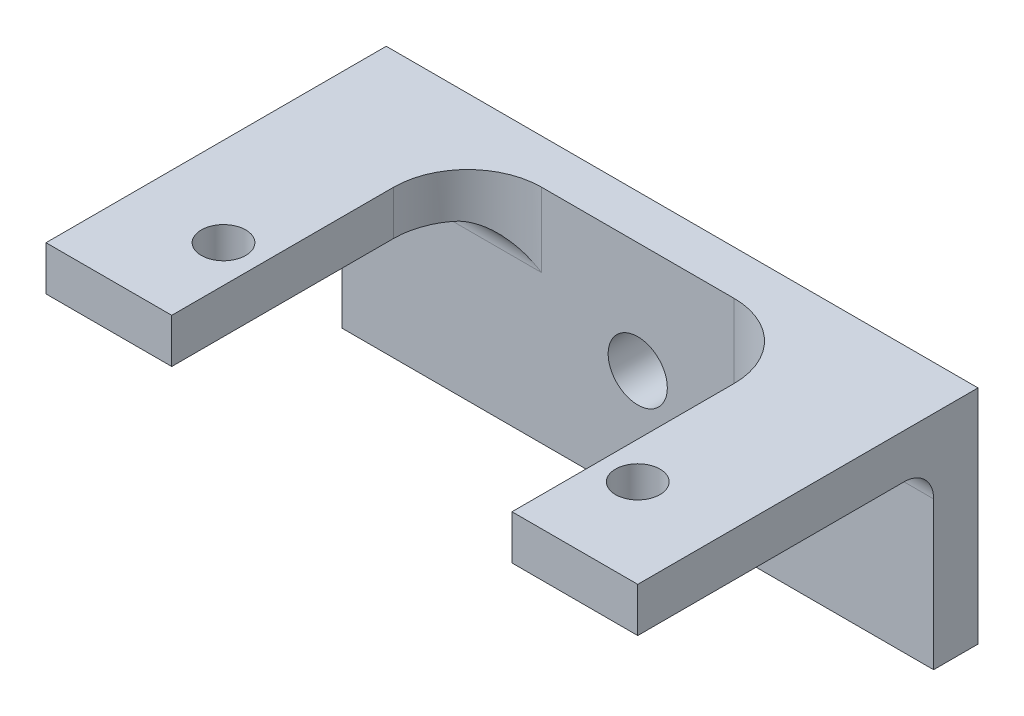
ISO-10303-21;
HEADER;
FILE_DESCRIPTION(('STEP AP214'),'2;1');
FILE_NAME('part.step','',(''),(''),'','','');
FILE_SCHEMA(('AUTOMOTIVE_DESIGN { 1 0 10303 214 1 1 1 1 }'));
ENDSEC;
DATA;
#1=APPLICATION_CONTEXT('core data for automotive mechanical design processes');
#2=APPLICATION_PROTOCOL_DEFINITION('international standard','automotive_design',2000,#1);
#3=PRODUCT_CONTEXT('',#1,'mechanical');
#4=PRODUCT('Part','Part','',(#3));
#5=PRODUCT_RELATED_PRODUCT_CATEGORY('part','',(#4));
#6=PRODUCT_DEFINITION_FORMATION('','',#4);
#7=PRODUCT_DEFINITION_CONTEXT('part definition',#1,'design');
#8=PRODUCT_DEFINITION('design','',#6,#7);
#9=PRODUCT_DEFINITION_SHAPE('','',#8);
#10=(LENGTH_UNIT() NAMED_UNIT(*) SI_UNIT(.MILLI.,.METRE.));
#11=(NAMED_UNIT(*) PLANE_ANGLE_UNIT() SI_UNIT($,.RADIAN.));
#12=(NAMED_UNIT(*) SI_UNIT($,.STERADIAN.) SOLID_ANGLE_UNIT());
#13=UNCERTAINTY_MEASURE_WITH_UNIT(LENGTH_MEASURE(1.E-05),#10,'distance_accuracy_value','');
#14=(GEOMETRIC_REPRESENTATION_CONTEXT(3) GLOBAL_UNCERTAINTY_ASSIGNED_CONTEXT((#13)) GLOBAL_UNIT_ASSIGNED_CONTEXT((#10,
#11,#12)) REPRESENTATION_CONTEXT('',''));
#15=CARTESIAN_POINT('',(0.,0.,0.));
#16=DIRECTION('',(0.,0.,1.));
#17=DIRECTION('',(1.,0.,0.));
#18=AXIS2_PLACEMENT_3D('',#15,#16,#17);
#19=CARTESIAN_POINT('',(0.,0.,3.));
#20=DIRECTION('',(0.,0.,1.));
#21=DIRECTION('',(1.,0.,0.));
#22=AXIS2_PLACEMENT_3D('',#19,#20,#21);
#23=PLANE('',#22);
#24=CARTESIAN_POINT('',(-20.,7.5,3.));
#25=DIRECTION('',(0.,0.,1.));
#26=DIRECTION('',(1.,0.,0.));
#27=AXIS2_PLACEMENT_3D('',#24,#25,#26);
#28=CIRCLE('',#27,2.);
#29=CARTESIAN_POINT('',(-18.,7.5,3.));
#30=VERTEX_POINT('',#29);
#31=EDGE_CURVE('E187',#30,#30,#28,.T.);
#32=ORIENTED_EDGE('',*,*,#31,.F.);
#33=EDGE_LOOP('',(#32));
#34=FACE_BOUND('',#33,.T.);
#35=DIRECTION('',(1.,0.,0.));
#36=VECTOR('',#35,1.);
#37=CARTESIAN_POINT('',(0.,10.,3.));
#38=LINE('',#37,#36);
#39=CARTESIAN_POINT('',(0.,10.,3.));
#40=VERTEX_POINT('',#39);
#41=CARTESIAN_POINT('',(-13.5,10.,3.));
#42=VERTEX_POINT('',#41);
#43=EDGE_CURVE('E225',#40,#42,#38,.F.);
#44=ORIENTED_EDGE('',*,*,#43,.T.);
#45=DIRECTION('',(0.,-1.,0.));
#46=VECTOR('',#45,1.);
#47=CARTESIAN_POINT('',(-13.5,0.,3.));
#48=LINE('',#47,#46);
#49=CARTESIAN_POINT('',(-13.5,15.,3.));
#50=VERTEX_POINT('',#49);
#51=EDGE_CURVE('E237',#42,#50,#48,.F.);
#52=ORIENTED_EDGE('',*,*,#51,.T.);
#53=DIRECTION('',(-1.,0.,0.));
#54=VECTOR('',#53,1.);
#55=CARTESIAN_POINT('',(-40.,15.,3.));
#56=LINE('',#55,#54);
#57=CARTESIAN_POINT('',(-26.5,15.,3.));
#58=VERTEX_POINT('',#57);
#59=EDGE_CURVE('E201',#50,#58,#56,.T.);
#60=ORIENTED_EDGE('',*,*,#59,.T.);
#61=DIRECTION('',(0.,1.,0.));
#62=VECTOR('',#61,1.);
#63=CARTESIAN_POINT('',(-26.5,0.,3.));
#64=LINE('',#63,#62);
#65=CARTESIAN_POINT('',(-26.5,10.,3.));
#66=VERTEX_POINT('',#65);
#67=EDGE_CURVE('E234',#58,#66,#64,.F.);
#68=ORIENTED_EDGE('',*,*,#67,.T.);
#69=DIRECTION('',(1.,0.,0.));
#70=VECTOR('',#69,1.);
#71=CARTESIAN_POINT('',(0.,10.,3.));
#72=LINE('',#71,#70);
#73=CARTESIAN_POINT('',(-40.,10.,3.));
#74=VERTEX_POINT('',#73);
#75=EDGE_CURVE('E223',#66,#74,#72,.F.);
#76=ORIENTED_EDGE('',*,*,#75,.T.);
#77=DIRECTION('',(0.,-1.,0.));
#78=VECTOR('',#77,1.);
#79=CARTESIAN_POINT('',(-40.,15.,3.));
#80=LINE('',#79,#78);
#81=CARTESIAN_POINT('',(-40.,0.,3.));
#82=VERTEX_POINT('',#81);
#83=EDGE_CURVE('E193',#74,#82,#80,.T.);
#84=ORIENTED_EDGE('',*,*,#83,.T.);
#85=DIRECTION('',(1.,0.,0.));
#86=VECTOR('',#85,1.);
#87=CARTESIAN_POINT('',(-40.,0.,3.));
#88=LINE('',#87,#86);
#89=CARTESIAN_POINT('',(0.,0.,3.));
#90=VERTEX_POINT('',#89);
#91=EDGE_CURVE('E195',#82,#90,#88,.T.);
#92=ORIENTED_EDGE('',*,*,#91,.T.);
#93=DIRECTION('',(0.,1.,0.));
#94=VECTOR('',#93,1.);
#95=CARTESIAN_POINT('',(0.,15.,3.));
#96=LINE('',#95,#94);
#97=EDGE_CURVE('E198',#90,#40,#96,.T.);
#98=ORIENTED_EDGE('',*,*,#97,.T.);
#99=EDGE_LOOP('',(#44,#52,#60,#68,#76,#84,#92,#98));
#100=FACE_BOUND('',#99,.T.);
#101=ADVANCED_FACE('F33',(#34,#100),#23,.T.);
#102=CARTESIAN_POINT('',(0.,0.,0.));
#103=DIRECTION('',(0.,0.,1.));
#104=DIRECTION('',(1.,0.,0.));
#105=AXIS2_PLACEMENT_3D('',#102,#103,#104);
#106=PLANE('',#105);
#107=DIRECTION('',(0.,-1.,0.));
#108=VECTOR('',#107,1.);
#109=CARTESIAN_POINT('',(-40.,15.,0.));
#110=LINE('',#109,#108);
#111=CARTESIAN_POINT('',(-40.,15.,0.));
#112=VERTEX_POINT('',#111);
#113=CARTESIAN_POINT('',(-40.,0.,0.));
#114=VERTEX_POINT('',#113);
#115=EDGE_CURVE('E190',#112,#114,#110,.T.);
#116=ORIENTED_EDGE('',*,*,#115,.F.);
#117=DIRECTION('',(-1.,0.,0.));
#118=VECTOR('',#117,1.);
#119=CARTESIAN_POINT('',(-40.,15.,0.));
#120=LINE('',#119,#118);
#121=CARTESIAN_POINT('',(0.,15.,0.));
#122=VERTEX_POINT('',#121);
#123=EDGE_CURVE('E196',#122,#112,#120,.T.);
#124=ORIENTED_EDGE('',*,*,#123,.F.);
#125=DIRECTION('',(0.,1.,0.));
#126=VECTOR('',#125,1.);
#127=CARTESIAN_POINT('',(0.,15.,0.));
#128=LINE('',#127,#126);
#129=CARTESIAN_POINT('',(0.,0.,0.));
#130=VERTEX_POINT('',#129);
#131=EDGE_CURVE('E209',#130,#122,#128,.T.);
#132=ORIENTED_EDGE('',*,*,#131,.F.);
#133=DIRECTION('',(1.,0.,0.));
#134=VECTOR('',#133,1.);
#135=CARTESIAN_POINT('',(-40.,0.,0.));
#136=LINE('',#135,#134);
#137=EDGE_CURVE('E207',#114,#130,#136,.T.);
#138=ORIENTED_EDGE('',*,*,#137,.F.);
#139=EDGE_LOOP('',(#116,#124,#132,#138));
#140=FACE_BOUND('',#139,.T.);
#141=CARTESIAN_POINT('',(-20.,7.5,0.));
#142=DIRECTION('',(0.,0.,1.));
#143=DIRECTION('',(1.,0.,0.));
#144=AXIS2_PLACEMENT_3D('',#141,#142,#143);
#145=CIRCLE('',#144,2.);
#146=CARTESIAN_POINT('',(-18.,7.5,0.));
#147=VERTEX_POINT('',#146);
#148=EDGE_CURVE('E186',#147,#147,#145,.T.);
#149=ORIENTED_EDGE('',*,*,#148,.T.);
#150=EDGE_LOOP('',(#149));
#151=FACE_BOUND('',#150,.T.);
#152=ADVANCED_FACE('F301',(#140,#151),#106,.F.);
#153=CARTESIAN_POINT('',(-40.,15.,3.));
#154=DIRECTION('',(1.,0.,0.));
#155=DIRECTION('',(0.,1.,0.));
#156=AXIS2_PLACEMENT_3D('',#153,#154,#155);
#157=PLANE('',#156);
#158=ORIENTED_EDGE('',*,*,#115,.T.);
#159=DIRECTION('',(0.,0.,-1.));
#160=VECTOR('',#159,1.);
#161=CARTESIAN_POINT('',(-40.,0.,3.));
#162=LINE('',#161,#160);
#163=EDGE_CURVE('E219',#82,#114,#162,.T.);
#164=ORIENTED_EDGE('',*,*,#163,.F.);
#165=ORIENTED_EDGE('',*,*,#83,.F.);
#166=CARTESIAN_POINT('',(-40.,10.,5.));
#167=DIRECTION('',(1.,0.,0.));
#168=DIRECTION('',(0.,1.,0.));
#169=AXIS2_PLACEMENT_3D('',#166,#167,#168);
#170=CIRCLE('',#169,2.);
#171=CARTESIAN_POINT('',(-40.,12.,5.));
#172=VERTEX_POINT('',#171);
#173=EDGE_CURVE('E230',#74,#172,#170,.T.);
#174=ORIENTED_EDGE('',*,*,#173,.T.);
#175=DIRECTION('',(0.,0.,-1.));
#176=VECTOR('',#175,1.);
#177=CARTESIAN_POINT('',(-40.,12.,23.));
#178=LINE('',#177,#176);
#179=CARTESIAN_POINT('',(-40.,12.,23.));
#180=VERTEX_POINT('',#179);
#181=EDGE_CURVE('E184',#180,#172,#178,.T.);
#182=ORIENTED_EDGE('',*,*,#181,.F.);
#183=DIRECTION('',(0.,-1.,0.));
#184=VECTOR('',#183,1.);
#185=CARTESIAN_POINT('',(-40.,15.,23.));
#186=LINE('',#185,#184);
#187=CARTESIAN_POINT('',(-40.,15.,23.));
#188=VERTEX_POINT('',#187);
#189=EDGE_CURVE('E163',#188,#180,#186,.T.);
#190=ORIENTED_EDGE('',*,*,#189,.F.);
#191=DIRECTION('',(0.,0.,-1.));
#192=VECTOR('',#191,1.);
#193=CARTESIAN_POINT('',(-40.,15.,3.));
#194=LINE('',#193,#192);
#195=EDGE_CURVE('E204',#188,#112,#194,.T.);
#196=ORIENTED_EDGE('',*,*,#195,.T.);
#197=EDGE_LOOP('',(#158,#164,#165,#174,#182,#190,#196));
#198=FACE_BOUND('',#197,.T.);
#199=ADVANCED_FACE('F281',(#198),#157,.F.);
#200=CARTESIAN_POINT('',(-40.,0.,3.));
#201=DIRECTION('',(0.,1.,0.));
#202=DIRECTION('',(0.,0.,1.));
#203=AXIS2_PLACEMENT_3D('',#200,#201,#202);
#204=PLANE('',#203);
#205=ORIENTED_EDGE('',*,*,#137,.T.);
#206=DIRECTION('',(0.,0.,-1.));
#207=VECTOR('',#206,1.);
#208=CARTESIAN_POINT('',(0.,0.,3.));
#209=LINE('',#208,#207);
#210=EDGE_CURVE('E216',#90,#130,#209,.T.);
#211=ORIENTED_EDGE('',*,*,#210,.F.);
#212=ORIENTED_EDGE('',*,*,#91,.F.);
#213=ORIENTED_EDGE('',*,*,#163,.T.);
#214=EDGE_LOOP('',(#205,#211,#212,#213));
#215=FACE_BOUND('',#214,.T.);
#216=ADVANCED_FACE('F285',(#215),#204,.F.);
#217=CARTESIAN_POINT('',(0.,15.,3.));
#218=DIRECTION('',(-1.,0.,0.));
#219=DIRECTION('',(0.,-1.,0.));
#220=AXIS2_PLACEMENT_3D('',#217,#218,#219);
#221=PLANE('',#220);
#222=ORIENTED_EDGE('',*,*,#131,.T.);
#223=DIRECTION('',(0.,0.,-1.));
#224=VECTOR('',#223,1.);
#225=CARTESIAN_POINT('',(0.,15.,3.));
#226=LINE('',#225,#224);
#227=CARTESIAN_POINT('',(0.,15.,23.));
#228=VERTEX_POINT('',#227);
#229=EDGE_CURVE('E214',#228,#122,#226,.T.);
#230=ORIENTED_EDGE('',*,*,#229,.F.);
#231=DIRECTION('',(0.,1.,0.));
#232=VECTOR('',#231,1.);
#233=CARTESIAN_POINT('',(0.,15.,23.));
#234=LINE('',#233,#232);
#235=CARTESIAN_POINT('',(0.,12.,23.));
#236=VERTEX_POINT('',#235);
#237=EDGE_CURVE('E154',#236,#228,#234,.T.);
#238=ORIENTED_EDGE('',*,*,#237,.F.);
#239=DIRECTION('',(0.,0.,-1.));
#240=VECTOR('',#239,1.);
#241=CARTESIAN_POINT('',(0.,12.,23.));
#242=LINE('',#241,#240);
#243=CARTESIAN_POINT('',(0.,12.,5.));
#244=VERTEX_POINT('',#243);
#245=EDGE_CURVE('E168',#236,#244,#242,.T.);
#246=ORIENTED_EDGE('',*,*,#245,.T.);
#247=CARTESIAN_POINT('',(0.,10.,5.));
#248=DIRECTION('',(-1.,0.,0.));
#249=DIRECTION('',(0.,-1.,0.));
#250=AXIS2_PLACEMENT_3D('',#247,#248,#249);
#251=CIRCLE('',#250,2.);
#252=EDGE_CURVE('E228',#244,#40,#251,.T.);
#253=ORIENTED_EDGE('',*,*,#252,.T.);
#254=ORIENTED_EDGE('',*,*,#97,.F.);
#255=ORIENTED_EDGE('',*,*,#210,.T.);
#256=EDGE_LOOP('',(#222,#230,#238,#246,#253,#254,#255));
#257=FACE_BOUND('',#256,.T.);
#258=ADVANCED_FACE('F297',(#257),#221,.F.);
#259=CARTESIAN_POINT('',(-40.,15.,3.));
#260=DIRECTION('',(0.,-1.,0.));
#261=DIRECTION('',(0.,0.,-1.));
#262=AXIS2_PLACEMENT_3D('',#259,#260,#261);
#263=PLANE('',#262);
#264=CARTESIAN_POINT('',(-6.,15.,17.));
#265=DIRECTION('',(0.,1.,0.));
#266=DIRECTION('',(0.,0.,-1.));
#267=AXIS2_PLACEMENT_3D('',#264,#265,#266);
#268=CIRCLE('',#267,1.5);
#269=CARTESIAN_POINT('',(-6.,15.,18.5));
#270=VERTEX_POINT('',#269);
#271=EDGE_CURVE('E493',#270,#270,#268,.T.);
#272=ORIENTED_EDGE('',*,*,#271,.F.);
#273=EDGE_LOOP('',(#272));
#274=FACE_BOUND('',#273,.T.);
#275=CARTESIAN_POINT('',(-34.,15.,17.));
#276=DIRECTION('',(0.,1.,0.));
#277=DIRECTION('',(0.,0.,1.));
#278=AXIS2_PLACEMENT_3D('',#275,#276,#277);
#279=CIRCLE('',#278,1.5);
#280=CARTESIAN_POINT('',(-34.,15.,18.5));
#281=VERTEX_POINT('',#280);
#282=EDGE_CURVE('E484',#281,#281,#279,.T.);
#283=ORIENTED_EDGE('',*,*,#282,.F.);
#284=EDGE_LOOP('',(#283));
#285=FACE_BOUND('',#284,.T.);
#286=ORIENTED_EDGE('',*,*,#123,.T.);
#287=ORIENTED_EDGE('',*,*,#195,.F.);
#288=DIRECTION('',(-1.,0.,0.));
#289=VECTOR('',#288,1.);
#290=CARTESIAN_POINT('',(-40.,15.,23.));
#291=LINE('',#290,#289);
#292=CARTESIAN_POINT('',(-31.5,15.,23.));
#293=VERTEX_POINT('',#292);
#294=EDGE_CURVE('E175',#293,#188,#291,.T.);
#295=ORIENTED_EDGE('',*,*,#294,.F.);
#296=DIRECTION('',(0.,0.,-1.));
#297=VECTOR('',#296,1.);
#298=CARTESIAN_POINT('',(-31.5,15.,23.));
#299=LINE('',#298,#297);
#300=CARTESIAN_POINT('',(-31.5,15.,8.));
#301=VERTEX_POINT('',#300);
#302=EDGE_CURVE('E178',#293,#301,#299,.T.);
#303=ORIENTED_EDGE('',*,*,#302,.T.);
#304=CARTESIAN_POINT('',(-26.5,15.,8.));
#305=DIRECTION('',(0.,-1.,0.));
#306=DIRECTION('',(0.,0.,-1.));
#307=AXIS2_PLACEMENT_3D('',#304,#305,#306);
#308=CIRCLE('',#307,5.);
#309=EDGE_CURVE('E266',#301,#58,#308,.T.);
#310=ORIENTED_EDGE('',*,*,#309,.T.);
#311=ORIENTED_EDGE('',*,*,#59,.F.);
#312=CARTESIAN_POINT('',(-13.5,15.,8.));
#313=DIRECTION('',(0.,-1.,0.));
#314=DIRECTION('',(0.,0.,-1.));
#315=AXIS2_PLACEMENT_3D('',#312,#313,#314);
#316=CIRCLE('',#315,5.);
#317=CARTESIAN_POINT('',(-8.5,15.,8.));
#318=VERTEX_POINT('',#317);
#319=EDGE_CURVE('E162',#50,#318,#316,.T.);
#320=ORIENTED_EDGE('',*,*,#319,.T.);
#321=DIRECTION('',(0.,0.,-1.));
#322=VECTOR('',#321,1.);
#323=CARTESIAN_POINT('',(-8.5,15.,23.));
#324=LINE('',#323,#322);
#325=CARTESIAN_POINT('',(-8.5,15.,23.));
#326=VERTEX_POINT('',#325);
#327=EDGE_CURVE('E141',#326,#318,#324,.T.);
#328=ORIENTED_EDGE('',*,*,#327,.F.);
#329=DIRECTION('',(-1.,0.,0.));
#330=VECTOR('',#329,1.);
#331=CARTESIAN_POINT('',(0.,15.,23.));
#332=LINE('',#331,#330);
#333=EDGE_CURVE('E148',#228,#326,#332,.T.);
#334=ORIENTED_EDGE('',*,*,#333,.F.);
#335=ORIENTED_EDGE('',*,*,#229,.T.);
#336=EDGE_LOOP('',(#286,#287,#295,#303,#310,#311,#320,#328,#334,#335));
#337=FACE_BOUND('',#336,.T.);
#338=ADVANCED_FACE('F159',(#274,#285,#337),#263,.F.);
#339=CARTESIAN_POINT('',(-20.,7.5,3.));
#340=DIRECTION('',(0.,0.,-1.));
#341=DIRECTION('',(-1.,0.,0.));
#342=AXIS2_PLACEMENT_3D('',#339,#340,#341);
#343=CYLINDRICAL_SURFACE('',#342,2.);
#344=ORIENTED_EDGE('',*,*,#31,.T.);
#345=EDGE_LOOP('',(#344));
#346=FACE_BOUND('',#345,.T.);
#347=ORIENTED_EDGE('',*,*,#148,.F.);
#348=EDGE_LOOP('',(#347));
#349=FACE_BOUND('',#348,.T.);
#350=ADVANCED_FACE('F307',(#346,#349),#343,.F.);
#351=CARTESIAN_POINT('',(-40.,12.,23.));
#352=DIRECTION('',(0.,1.,0.));
#353=DIRECTION('',(0.,0.,1.));
#354=AXIS2_PLACEMENT_3D('',#351,#352,#353);
#355=PLANE('',#354);
#356=CARTESIAN_POINT('',(-34.,12.,17.));
#357=DIRECTION('',(0.,1.,0.));
#358=DIRECTION('',(0.,0.,1.));
#359=AXIS2_PLACEMENT_3D('',#356,#357,#358);
#360=CIRCLE('',#359,1.5);
#361=CARTESIAN_POINT('',(-34.,12.,18.5));
#362=VERTEX_POINT('',#361);
#363=EDGE_CURVE('E157',#362,#362,#360,.F.);
#364=ORIENTED_EDGE('',*,*,#363,.F.);
#365=EDGE_LOOP('',(#364));
#366=FACE_BOUND('',#365,.T.);
#367=ORIENTED_EDGE('',*,*,#181,.T.);
#368=DIRECTION('',(1.,0.,0.));
#369=VECTOR('',#368,1.);
#370=CARTESIAN_POINT('',(-40.,12.,5.));
#371=LINE('',#370,#369);
#372=CARTESIAN_POINT('',(-30.5000000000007,12.,5.));
#373=VERTEX_POINT('',#372);
#374=EDGE_CURVE('E48',#172,#373,#371,.T.);
#375=ORIENTED_EDGE('',*,*,#374,.T.);
#376=CARTESIAN_POINT('',(-26.5,12.,8.));
#377=DIRECTION('',(0.,1.,0.));
#378=DIRECTION('',(0.,0.,1.));
#379=AXIS2_PLACEMENT_3D('',#376,#377,#378);
#380=CIRCLE('',#379,5.);
#381=CARTESIAN_POINT('',(-31.5,12.,8.));
#382=VERTEX_POINT('',#381);
#383=EDGE_CURVE('E11',#373,#382,#380,.T.);
#384=ORIENTED_EDGE('',*,*,#383,.T.);
#385=DIRECTION('',(0.,0.,-1.));
#386=VECTOR('',#385,1.);
#387=CARTESIAN_POINT('',(-31.5,12.,23.));
#388=LINE('',#387,#386);
#389=CARTESIAN_POINT('',(-31.5,12.,23.));
#390=VERTEX_POINT('',#389);
#391=EDGE_CURVE('E181',#390,#382,#388,.T.);
#392=ORIENTED_EDGE('',*,*,#391,.F.);
#393=DIRECTION('',(1.,0.,0.));
#394=VECTOR('',#393,1.);
#395=CARTESIAN_POINT('',(-40.,12.,23.));
#396=LINE('',#395,#394);
#397=EDGE_CURVE('E166',#180,#390,#396,.T.);
#398=ORIENTED_EDGE('',*,*,#397,.F.);
#399=EDGE_LOOP('',(#367,#375,#384,#392,#398));
#400=FACE_BOUND('',#399,.T.);
#401=ADVANCED_FACE('F309',(#366,#400),#355,.F.);
#402=CARTESIAN_POINT('',(-31.5,15.,23.));
#403=DIRECTION('',(-1.,0.,0.));
#404=DIRECTION('',(0.,-1.,0.));
#405=AXIS2_PLACEMENT_3D('',#402,#403,#404);
#406=PLANE('',#405);
#407=ORIENTED_EDGE('',*,*,#391,.T.);
#408=DIRECTION('',(0.,1.,0.));
#409=VECTOR('',#408,1.);
#410=CARTESIAN_POINT('',(-31.5,15.,8.));
#411=LINE('',#410,#409);
#412=EDGE_CURVE('E239',#382,#301,#411,.T.);
#413=ORIENTED_EDGE('',*,*,#412,.T.);
#414=ORIENTED_EDGE('',*,*,#302,.F.);
#415=DIRECTION('',(0.,1.,0.));
#416=VECTOR('',#415,1.);
#417=CARTESIAN_POINT('',(-31.5,15.,23.));
#418=LINE('',#417,#416);
#419=EDGE_CURVE('E173',#390,#293,#418,.T.);
#420=ORIENTED_EDGE('',*,*,#419,.F.);
#421=EDGE_LOOP('',(#407,#413,#414,#420));
#422=FACE_BOUND('',#421,.T.);
#423=ADVANCED_FACE('F317',(#422),#406,.F.);
#424=CARTESIAN_POINT('',(0.,0.,23.));
#425=DIRECTION('',(0.,0.,1.));
#426=DIRECTION('',(1.,0.,0.));
#427=AXIS2_PLACEMENT_3D('',#424,#425,#426);
#428=PLANE('',#427);
#429=ORIENTED_EDGE('',*,*,#189,.T.);
#430=ORIENTED_EDGE('',*,*,#397,.T.);
#431=ORIENTED_EDGE('',*,*,#419,.T.);
#432=ORIENTED_EDGE('',*,*,#294,.T.);
#433=EDGE_LOOP('',(#429,#430,#431,#432));
#434=FACE_BOUND('',#433,.T.);
#435=ADVANCED_FACE('F362',(#434),#428,.T.);
#436=CARTESIAN_POINT('',(-8.5,15.,23.));
#437=DIRECTION('',(1.,0.,0.));
#438=DIRECTION('',(0.,1.,0.));
#439=AXIS2_PLACEMENT_3D('',#436,#437,#438);
#440=PLANE('',#439);
#441=ORIENTED_EDGE('',*,*,#327,.T.);
#442=DIRECTION('',(0.,-1.,0.));
#443=VECTOR('',#442,1.);
#444=CARTESIAN_POINT('',(-8.5,15.,8.));
#445=LINE('',#444,#443);
#446=CARTESIAN_POINT('',(-8.49999999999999,12.,8.));
#447=VERTEX_POINT('',#446);
#448=EDGE_CURVE('E232',#318,#447,#445,.T.);
#449=ORIENTED_EDGE('',*,*,#448,.T.);
#450=DIRECTION('',(0.,0.,-1.));
#451=VECTOR('',#450,1.);
#452=CARTESIAN_POINT('',(-8.49999999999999,12.,23.));
#453=LINE('',#452,#451);
#454=CARTESIAN_POINT('',(-8.49999999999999,12.,23.));
#455=VERTEX_POINT('',#454);
#456=EDGE_CURVE('E144',#455,#447,#453,.T.);
#457=ORIENTED_EDGE('',*,*,#456,.F.);
#458=DIRECTION('',(0.,-1.,0.));
#459=VECTOR('',#458,1.);
#460=CARTESIAN_POINT('',(-8.5,15.,23.));
#461=LINE('',#460,#459);
#462=EDGE_CURVE('E136',#326,#455,#461,.T.);
#463=ORIENTED_EDGE('',*,*,#462,.F.);
#464=EDGE_LOOP('',(#441,#449,#457,#463));
#465=FACE_BOUND('',#464,.T.);
#466=ADVANCED_FACE('F138',(#465),#440,.F.);
#467=CARTESIAN_POINT('',(0.,12.,23.));
#468=DIRECTION('',(0.,1.,0.));
#469=DIRECTION('',(-1.,0.,0.));
#470=AXIS2_PLACEMENT_3D('',#467,#468,#469);
#471=PLANE('',#470);
#472=CARTESIAN_POINT('',(-6.,12.,17.));
#473=DIRECTION('',(0.,1.,0.));
#474=DIRECTION('',(-1.,0.,0.));
#475=AXIS2_PLACEMENT_3D('',#472,#473,#474);
#476=CIRCLE('',#475,1.5);
#477=CARTESIAN_POINT('',(-6.,12.,18.5));
#478=VERTEX_POINT('',#477);
#479=EDGE_CURVE('E488',#478,#478,#476,.F.);
#480=ORIENTED_EDGE('',*,*,#479,.F.);
#481=EDGE_LOOP('',(#480));
#482=FACE_BOUND('',#481,.T.);
#483=ORIENTED_EDGE('',*,*,#456,.T.);
#484=CARTESIAN_POINT('',(-13.5,12.,8.));
#485=DIRECTION('',(0.,1.,0.));
#486=DIRECTION('',(-1.,0.,0.));
#487=AXIS2_PLACEMENT_3D('',#484,#485,#486);
#488=CIRCLE('',#487,5.);
#489=CARTESIAN_POINT('',(-9.49999999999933,12.,5.));
#490=VERTEX_POINT('',#489);
#491=EDGE_CURVE('E242',#447,#490,#488,.T.);
#492=ORIENTED_EDGE('',*,*,#491,.T.);
#493=DIRECTION('',(1.,0.,0.));
#494=VECTOR('',#493,1.);
#495=CARTESIAN_POINT('',(0.,12.,5.));
#496=LINE('',#495,#494);
#497=EDGE_CURVE('E56',#490,#244,#496,.T.);
#498=ORIENTED_EDGE('',*,*,#497,.T.);
#499=ORIENTED_EDGE('',*,*,#245,.F.);
#500=DIRECTION('',(1.,0.,0.));
#501=VECTOR('',#500,1.);
#502=CARTESIAN_POINT('',(0.,12.,23.));
#503=LINE('',#502,#501);
#504=EDGE_CURVE('E147',#455,#236,#503,.T.);
#505=ORIENTED_EDGE('',*,*,#504,.F.);
#506=EDGE_LOOP('',(#483,#492,#498,#499,#505));
#507=FACE_BOUND('',#506,.T.);
#508=ADVANCED_FACE('F292',(#482,#507),#471,.F.);
#509=CARTESIAN_POINT('',(0.,0.,23.));
#510=DIRECTION('',(0.,0.,1.));
#511=DIRECTION('',(1.,0.,0.));
#512=AXIS2_PLACEMENT_3D('',#509,#510,#511);
#513=PLANE('',#512);
#514=ORIENTED_EDGE('',*,*,#333,.T.);
#515=ORIENTED_EDGE('',*,*,#462,.T.);
#516=ORIENTED_EDGE('',*,*,#504,.T.);
#517=ORIENTED_EDGE('',*,*,#237,.T.);
#518=EDGE_LOOP('',(#514,#515,#516,#517));
#519=FACE_BOUND('',#518,.T.);
#520=ADVANCED_FACE('F152',(#519),#513,.T.);
#521=CARTESIAN_POINT('',(-34.,-0.000999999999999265,17.));
#522=DIRECTION('',(0.,1.,0.));
#523=DIRECTION('',(0.,0.,1.));
#524=AXIS2_PLACEMENT_3D('',#521,#522,#523);
#525=CYLINDRICAL_SURFACE('',#524,1.5);
#526=CARTESIAN_POINT('',(-34.,15.,18.5));
#527=CARTESIAN_POINT('',(-34.,14.96875,18.5));
#528=CARTESIAN_POINT('',(-34.,14.9375,18.5));
#529=CARTESIAN_POINT('',(-34.,14.875,18.5));
#530=CARTESIAN_POINT('',(-34.,14.84375,18.5));
#531=CARTESIAN_POINT('',(-34.,14.78125,18.5));
#532=CARTESIAN_POINT('',(-34.,14.75,18.5));
#533=CARTESIAN_POINT('',(-34.,14.6875,18.5));
#534=CARTESIAN_POINT('',(-34.,14.65625,18.5));
#535=CARTESIAN_POINT('',(-34.,14.59375,18.5));
#536=CARTESIAN_POINT('',(-34.,14.5625,18.5));
#537=CARTESIAN_POINT('',(-34.,14.5,18.5));
#538=CARTESIAN_POINT('',(-34.,14.46875,18.5));
#539=CARTESIAN_POINT('',(-34.,14.40625,18.5));
#540=CARTESIAN_POINT('',(-34.,14.375,18.5));
#541=CARTESIAN_POINT('',(-34.,14.3125,18.5));
#542=CARTESIAN_POINT('',(-34.,14.28125,18.5));
#543=CARTESIAN_POINT('',(-34.,14.21875,18.5));
#544=CARTESIAN_POINT('',(-34.,14.1875,18.5));
#545=CARTESIAN_POINT('',(-34.,14.125,18.5));
#546=CARTESIAN_POINT('',(-34.,14.09375,18.5));
#547=CARTESIAN_POINT('',(-34.,14.03125,18.5));
#548=CARTESIAN_POINT('',(-34.,14.,18.5));
#549=CARTESIAN_POINT('',(-34.,13.9375,18.5));
#550=CARTESIAN_POINT('',(-34.,13.90625,18.5));
#551=CARTESIAN_POINT('',(-34.,13.84375,18.5));
#552=CARTESIAN_POINT('',(-34.,13.8125,18.5));
#553=CARTESIAN_POINT('',(-34.,13.75,18.5));
#554=CARTESIAN_POINT('',(-34.,13.71875,18.5));
#555=CARTESIAN_POINT('',(-34.,13.65625,18.5));
#556=CARTESIAN_POINT('',(-34.,13.625,18.5));
#557=CARTESIAN_POINT('',(-34.,13.5625,18.5));
#558=CARTESIAN_POINT('',(-34.,13.53125,18.5));
#559=CARTESIAN_POINT('',(-34.,13.46875,18.5));
#560=CARTESIAN_POINT('',(-34.,13.4375,18.5));
#561=CARTESIAN_POINT('',(-34.,13.375,18.5));
#562=CARTESIAN_POINT('',(-34.,13.34375,18.5));
#563=CARTESIAN_POINT('',(-34.,13.28125,18.5));
#564=CARTESIAN_POINT('',(-34.,13.25,18.5));
#565=CARTESIAN_POINT('',(-34.,13.1875,18.5));
#566=CARTESIAN_POINT('',(-34.,13.15625,18.5));
#567=CARTESIAN_POINT('',(-34.,13.09375,18.5));
#568=CARTESIAN_POINT('',(-34.,13.0625,18.5));
#569=CARTESIAN_POINT('',(-34.,13.,18.5));
#570=CARTESIAN_POINT('',(-34.,12.96875,18.5));
#571=CARTESIAN_POINT('',(-34.,12.90625,18.5));
#572=CARTESIAN_POINT('',(-34.,12.875,18.5));
#573=CARTESIAN_POINT('',(-34.,12.8125,18.5));
#574=CARTESIAN_POINT('',(-34.,12.78125,18.5));
#575=CARTESIAN_POINT('',(-34.,12.71875,18.5));
#576=CARTESIAN_POINT('',(-34.,12.6875,18.5));
#577=CARTESIAN_POINT('',(-34.,12.625,18.5));
#578=CARTESIAN_POINT('',(-34.,12.59375,18.5));
#579=CARTESIAN_POINT('',(-34.,12.53125,18.5));
#580=CARTESIAN_POINT('',(-34.,12.5,18.5));
#581=CARTESIAN_POINT('',(-34.,12.4375,18.5));
#582=CARTESIAN_POINT('',(-34.,12.40625,18.5));
#583=CARTESIAN_POINT('',(-34.,12.34375,18.5));
#584=CARTESIAN_POINT('',(-34.,12.3125,18.5));
#585=CARTESIAN_POINT('',(-34.,12.25,18.5));
#586=CARTESIAN_POINT('',(-34.,12.21875,18.5));
#587=CARTESIAN_POINT('',(-34.,12.15625,18.5));
#588=CARTESIAN_POINT('',(-34.,12.125,18.5));
#589=CARTESIAN_POINT('',(-34.,12.0625,18.5));
#590=CARTESIAN_POINT('',(-34.,12.03125,18.5));
#591=CARTESIAN_POINT('',(-34.,12.,18.5));
#592=B_SPLINE_CURVE_WITH_KNOTS('',3,(#526,#527,#528,#529,#530,#531,#532,#533,#534,#535,#536,
#537,#538,#539,#540,#541,#542,#543,#544,#545,#546,#547,#548,#549,#550,#551,#552,#553,#554,#555,
#556,#557,#558,#559,#560,#561,#562,#563,#564,#565,#566,#567,#568,#569,#570,#571,#572,#573,#574,
#575,#576,#577,#578,#579,#580,#581,#582,#583,#584,#585,#586,#587,#588,#589,#590,#591),
.UNSPECIFIED.,.F.,.F.,(4,2,2,2,2,2,2,2,2,2,2,2,2,2,2,2,2,2,2,2,2,2,2,2,2,2,2,2,2,2,2,2,4),(0.,
0.0937500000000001,0.1875,0.28125,0.375,0.46875,0.5625,0.656250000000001,0.750000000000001,
0.843749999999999,0.937499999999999,1.03125,1.125,1.21875,1.3125,1.40625,1.5,1.59375,1.6875,
1.78125,1.875,1.96875,2.0625,2.15625,2.25,2.34375,2.4375,2.53125,2.625,2.71875,2.8125,2.90625,
3.),.UNSPECIFIED.);
#593=EDGE_CURVE('BSEAM413',#281,#362,#592,.T.);
#594=ORIENTED_EDGE('',*,*,#282,.T.);
#595=ORIENTED_EDGE('',*,*,#363,.T.);
#596=ORIENTED_EDGE('',*,*,#593,.T.);
#597=ORIENTED_EDGE('',*,*,#593,.F.);
#598=EDGE_LOOP('',(#594,#596,#595,#597));
#599=FACE_BOUND('',#598,.T.);
#600=ADVANCED_FACE('F413',(#599),#525,.F.);
#601=CARTESIAN_POINT('',(-6.,-0.000999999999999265,17.));
#602=DIRECTION('',(0.,1.,0.));
#603=DIRECTION('',(0.,0.,1.));
#604=AXIS2_PLACEMENT_3D('',#601,#602,#603);
#605=CYLINDRICAL_SURFACE('',#604,1.5);
#606=CARTESIAN_POINT('',(-6.,15.,18.5));
#607=CARTESIAN_POINT('',(-6.,14.96875,18.5));
#608=CARTESIAN_POINT('',(-6.,14.9375,18.5));
#609=CARTESIAN_POINT('',(-6.,14.875,18.5));
#610=CARTESIAN_POINT('',(-6.,14.84375,18.5));
#611=CARTESIAN_POINT('',(-6.,14.78125,18.5));
#612=CARTESIAN_POINT('',(-6.,14.75,18.5));
#613=CARTESIAN_POINT('',(-6.,14.6875,18.5));
#614=CARTESIAN_POINT('',(-6.,14.65625,18.5));
#615=CARTESIAN_POINT('',(-6.,14.59375,18.5));
#616=CARTESIAN_POINT('',(-6.,14.5625,18.5));
#617=CARTESIAN_POINT('',(-6.,14.5,18.5));
#618=CARTESIAN_POINT('',(-6.,14.46875,18.5));
#619=CARTESIAN_POINT('',(-6.,14.40625,18.5));
#620=CARTESIAN_POINT('',(-6.,14.375,18.5));
#621=CARTESIAN_POINT('',(-6.,14.3125,18.5));
#622=CARTESIAN_POINT('',(-6.,14.28125,18.5));
#623=CARTESIAN_POINT('',(-6.,14.21875,18.5));
#624=CARTESIAN_POINT('',(-6.,14.1875,18.5));
#625=CARTESIAN_POINT('',(-6.,14.125,18.5));
#626=CARTESIAN_POINT('',(-6.,14.09375,18.5));
#627=CARTESIAN_POINT('',(-6.,14.03125,18.5));
#628=CARTESIAN_POINT('',(-6.,14.,18.5));
#629=CARTESIAN_POINT('',(-6.,13.9375,18.5));
#630=CARTESIAN_POINT('',(-6.,13.90625,18.5));
#631=CARTESIAN_POINT('',(-6.,13.84375,18.5));
#632=CARTESIAN_POINT('',(-6.,13.8125,18.5));
#633=CARTESIAN_POINT('',(-6.,13.75,18.5));
#634=CARTESIAN_POINT('',(-6.,13.71875,18.5));
#635=CARTESIAN_POINT('',(-6.,13.65625,18.5));
#636=CARTESIAN_POINT('',(-6.,13.625,18.5));
#637=CARTESIAN_POINT('',(-6.,13.5625,18.5));
#638=CARTESIAN_POINT('',(-6.,13.53125,18.5));
#639=CARTESIAN_POINT('',(-6.,13.46875,18.5));
#640=CARTESIAN_POINT('',(-6.,13.4375,18.5));
#641=CARTESIAN_POINT('',(-6.,13.375,18.5));
#642=CARTESIAN_POINT('',(-6.,13.34375,18.5));
#643=CARTESIAN_POINT('',(-6.,13.28125,18.5));
#644=CARTESIAN_POINT('',(-6.,13.25,18.5));
#645=CARTESIAN_POINT('',(-6.,13.1875,18.5));
#646=CARTESIAN_POINT('',(-6.,13.15625,18.5));
#647=CARTESIAN_POINT('',(-6.,13.09375,18.5));
#648=CARTESIAN_POINT('',(-6.,13.0625,18.5));
#649=CARTESIAN_POINT('',(-6.,13.,18.5));
#650=CARTESIAN_POINT('',(-6.,12.96875,18.5));
#651=CARTESIAN_POINT('',(-6.,12.90625,18.5));
#652=CARTESIAN_POINT('',(-6.,12.875,18.5));
#653=CARTESIAN_POINT('',(-6.,12.8125,18.5));
#654=CARTESIAN_POINT('',(-6.,12.78125,18.5));
#655=CARTESIAN_POINT('',(-6.,12.71875,18.5));
#656=CARTESIAN_POINT('',(-6.,12.6875,18.5));
#657=CARTESIAN_POINT('',(-6.,12.625,18.5));
#658=CARTESIAN_POINT('',(-6.,12.59375,18.5));
#659=CARTESIAN_POINT('',(-6.,12.53125,18.5));
#660=CARTESIAN_POINT('',(-6.,12.5,18.5));
#661=CARTESIAN_POINT('',(-6.,12.4375,18.5));
#662=CARTESIAN_POINT('',(-6.,12.40625,18.5));
#663=CARTESIAN_POINT('',(-6.,12.34375,18.5));
#664=CARTESIAN_POINT('',(-6.,12.3125,18.5));
#665=CARTESIAN_POINT('',(-6.,12.25,18.5));
#666=CARTESIAN_POINT('',(-6.,12.21875,18.5));
#667=CARTESIAN_POINT('',(-6.,12.15625,18.5));
#668=CARTESIAN_POINT('',(-6.,12.125,18.5));
#669=CARTESIAN_POINT('',(-6.,12.0625,18.5));
#670=CARTESIAN_POINT('',(-6.,12.03125,18.5));
#671=CARTESIAN_POINT('',(-6.,12.,18.5));
#672=B_SPLINE_CURVE_WITH_KNOTS('',3,(#606,#607,#608,#609,#610,#611,#612,#613,#614,#615,#616,
#617,#618,#619,#620,#621,#622,#623,#624,#625,#626,#627,#628,#629,#630,#631,#632,#633,#634,#635,
#636,#637,#638,#639,#640,#641,#642,#643,#644,#645,#646,#647,#648,#649,#650,#651,#652,#653,#654,
#655,#656,#657,#658,#659,#660,#661,#662,#663,#664,#665,#666,#667,#668,#669,#670,#671),
.UNSPECIFIED.,.F.,.F.,(4,2,2,2,2,2,2,2,2,2,2,2,2,2,2,2,2,2,2,2,2,2,2,2,2,2,2,2,2,2,2,2,4),(0.,
0.0937500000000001,0.1875,0.28125,0.375,0.46875,0.5625,0.656250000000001,0.750000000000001,
0.843749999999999,0.937499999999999,1.03125,1.125,1.21875,1.3125,1.40625,1.5,1.59375,1.6875,
1.78125,1.875,1.96875,2.0625,2.15625,2.25,2.34375,2.4375,2.53125,2.625,2.71875,2.8125,2.90625,
3.),.UNSPECIFIED.);
#673=EDGE_CURVE('BSEAM384',#270,#478,#672,.T.);
#674=ORIENTED_EDGE('',*,*,#271,.T.);
#675=ORIENTED_EDGE('',*,*,#479,.T.);
#676=ORIENTED_EDGE('',*,*,#673,.T.);
#677=ORIENTED_EDGE('',*,*,#673,.F.);
#678=EDGE_LOOP('',(#674,#676,#675,#677));
#679=FACE_BOUND('',#678,.T.);
#680=ADVANCED_FACE('F384',(#679),#605,.F.);
#681=CARTESIAN_POINT('',(0.,10.,5.));
#682=DIRECTION('',(1.,0.,0.));
#683=DIRECTION('',(0.,1.,0.));
#684=AXIS2_PLACEMENT_3D('',#681,#682,#683);
#685=CYLINDRICAL_SURFACE('',#684,2.);
#686=ORIENTED_EDGE('',*,*,#497,.F.);
#687=CARTESIAN_POINT('',(-9.49999999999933,12.,5.));
#688=CARTESIAN_POINT('',(-9.55129193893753,11.9999932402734,4.93158584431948));
#689=CARTESIAN_POINT('',(-9.60432219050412,11.9964915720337,4.86455821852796));
#690=CARTESIAN_POINT('',(-9.71332731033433,11.9832890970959,4.73376301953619));
#691=CARTESIAN_POINT('',(-9.76929693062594,11.9735990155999,4.66999001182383));
#692=CARTESIAN_POINT('',(-9.88328476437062,11.9489228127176,4.5465415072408));
#693=CARTESIAN_POINT('',(-9.94127844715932,11.9339879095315,4.48683282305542));
#694=CARTESIAN_POINT('',(-10.0594732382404,11.8994777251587,4.37100202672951));
#695=CARTESIAN_POINT('',(-10.1196756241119,11.8798997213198,4.31488204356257));
#696=CARTESIAN_POINT('',(-10.2678914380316,11.8275558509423,4.18332284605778));
#697=CARTESIAN_POINT('',(-10.3568697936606,11.7927185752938,4.10978618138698));
#698=CARTESIAN_POINT('',(-10.537814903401,11.7163994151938,3.97029430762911));
#699=CARTESIAN_POINT('',(-10.6297823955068,11.6749158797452,3.90434098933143));
#700=CARTESIAN_POINT('',(-10.9103256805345,11.541888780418,3.71697330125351));
#701=CARTESIAN_POINT('',(-11.1026488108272,11.4421061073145,3.60683184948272));
#702=CARTESIAN_POINT('',(-11.4360068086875,11.2597364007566,3.4432848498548));
#703=CARTESIAN_POINT('',(-11.5756041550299,11.1806465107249,3.38270544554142));
#704=CARTESIAN_POINT('',(-11.8570864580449,11.0172062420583,3.27522285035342));
#705=CARTESIAN_POINT('',(-11.9989723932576,10.9328535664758,3.22832568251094));
#706=CARTESIAN_POINT('',(-12.283951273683,10.7606885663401,3.14787588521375));
#707=CARTESIAN_POINT('',(-12.4270410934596,10.6728838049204,3.11429569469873));
#708=CARTESIAN_POINT('',(-12.7141274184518,10.4949678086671,3.05998573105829));
#709=CARTESIAN_POINT('',(-12.8581236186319,10.4048573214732,3.03925184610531));
#710=CARTESIAN_POINT('',(-13.164074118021,10.2124452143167,3.00865251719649));
#711=CARTESIAN_POINT('',(-13.3260977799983,10.1099851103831,3.00040130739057));
#712=CARTESIAN_POINT('',(-13.4920318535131,10.0050394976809,3.00000476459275));
#713=CARTESIAN_POINT('',(-13.4960159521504,10.0025197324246,3.00000000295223));
#714=CARTESIAN_POINT('',(-13.5,10.,3.));
#715=B_SPLINE_CURVE_WITH_KNOTS('',3,(#687,#688,#689,#690,#691,#692,#693,#694,#695,#696,#697,
#698,#699,#700,#701,#702,#703,#704,#705,#706,#707,#708,#709,#710,#711,#712,#713,#714),
.UNSPECIFIED.,.F.,.F.,(4,2,2,2,2,2,2,2,2,2,2,2,2,4),(0.,0.256323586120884,0.512204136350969,
0.765652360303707,1.01924957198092,1.38041574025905,1.74167176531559,2.46784096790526,
2.98178501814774,3.49595497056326,4.00905516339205,4.52199103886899,5.09684964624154,
5.1109917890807),.UNSPECIFIED.);
#716=EDGE_CURVE('E244',#490,#42,#715,.T.);
#717=ORIENTED_EDGE('',*,*,#716,.T.);
#718=ORIENTED_EDGE('',*,*,#43,.F.);
#719=ORIENTED_EDGE('',*,*,#252,.F.);
#720=EDGE_LOOP('',(#686,#717,#718,#719));
#721=FACE_BOUND('',#720,.T.);
#722=ADVANCED_FACE('F251',(#721),#685,.F.);
#723=CARTESIAN_POINT('',(-40.,10.,5.));
#724=DIRECTION('',(1.,0.,0.));
#725=DIRECTION('',(0.,0.,-1.));
#726=AXIS2_PLACEMENT_3D('',#723,#724,#725);
#727=CYLINDRICAL_SURFACE('',#726,2.);
#728=ORIENTED_EDGE('',*,*,#173,.F.);
#729=ORIENTED_EDGE('',*,*,#75,.F.);
#730=CARTESIAN_POINT('',(-30.5000000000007,12.,5.));
#731=CARTESIAN_POINT('',(-30.4487080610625,11.9999932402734,4.93158584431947));
#732=CARTESIAN_POINT('',(-30.3956778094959,11.9964915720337,4.86455821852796));
#733=CARTESIAN_POINT('',(-30.2866726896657,11.9832890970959,4.73376301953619));
#734=CARTESIAN_POINT('',(-30.2307030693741,11.9735990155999,4.66999001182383));
#735=CARTESIAN_POINT('',(-30.1167152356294,11.9489228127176,4.5465415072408));
#736=CARTESIAN_POINT('',(-30.0587215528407,11.9339879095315,4.48683282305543));
#737=CARTESIAN_POINT('',(-29.9405267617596,11.8994777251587,4.37100202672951));
#738=CARTESIAN_POINT('',(-29.8803243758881,11.8798997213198,4.31488204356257));
#739=CARTESIAN_POINT('',(-29.7321085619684,11.8275558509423,4.18332284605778));
#740=CARTESIAN_POINT('',(-29.6431302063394,11.7927185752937,4.10978618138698));
#741=CARTESIAN_POINT('',(-29.462185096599,11.7163994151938,3.97029430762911));
#742=CARTESIAN_POINT('',(-29.3702176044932,11.6749158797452,3.90434098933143));
#743=CARTESIAN_POINT('',(-29.0896743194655,11.541888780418,3.71697330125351));
#744=CARTESIAN_POINT('',(-28.8973511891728,11.4421061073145,3.60683184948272));
#745=CARTESIAN_POINT('',(-28.5639931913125,11.2597364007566,3.4432848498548));
#746=CARTESIAN_POINT('',(-28.4243958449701,11.1806465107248,3.38270544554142));
#747=CARTESIAN_POINT('',(-28.1429135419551,11.0172062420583,3.27522285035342));
#748=CARTESIAN_POINT('',(-28.0010276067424,10.9328535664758,3.22832568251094));
#749=CARTESIAN_POINT('',(-27.716048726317,10.7606885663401,3.14787588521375));
#750=CARTESIAN_POINT('',(-27.5729589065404,10.6728838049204,3.11429569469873));
#751=CARTESIAN_POINT('',(-27.2858725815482,10.4949678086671,3.05998573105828));
#752=CARTESIAN_POINT('',(-27.1418763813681,10.4048573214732,3.03925184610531));
#753=CARTESIAN_POINT('',(-26.835925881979,10.2124452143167,3.00865251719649));
#754=CARTESIAN_POINT('',(-26.6739022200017,10.109985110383,3.00040130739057));
#755=CARTESIAN_POINT('',(-26.5079681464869,10.0050394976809,3.00000476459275));
#756=CARTESIAN_POINT('',(-26.5039840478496,10.0025197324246,3.00000000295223));
#757=CARTESIAN_POINT('',(-26.5,10.,3.));
#758=B_SPLINE_CURVE_WITH_KNOTS('',3,(#730,#731,#732,#733,#734,#735,#736,#737,#738,#739,#740,
#741,#742,#743,#744,#745,#746,#747,#748,#749,#750,#751,#752,#753,#754,#755,#756,#757),
.UNSPECIFIED.,.F.,.F.,(4,2,2,2,2,2,2,2,2,2,2,2,2,4),(0.,0.256323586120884,0.51220413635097,
0.765652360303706,1.01924957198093,1.38041574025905,1.74167176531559,2.46784096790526,
2.98178501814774,3.49595497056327,4.00905516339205,4.521991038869,5.09684964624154,
5.1109917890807),.UNSPECIFIED.);
#759=EDGE_CURVE('E42',#66,#373,#758,.F.);
#760=ORIENTED_EDGE('',*,*,#759,.T.);
#761=ORIENTED_EDGE('',*,*,#374,.F.);
#762=EDGE_LOOP('',(#728,#729,#760,#761));
#763=FACE_BOUND('',#762,.T.);
#764=ADVANCED_FACE('F258',(#763),#727,.F.);
#765=CARTESIAN_POINT('',(-13.5,15.,8.));
#766=DIRECTION('',(0.,-1.,0.));
#767=DIRECTION('',(1.,0.,0.));
#768=AXIS2_PLACEMENT_3D('',#765,#766,#767);
#769=CYLINDRICAL_SURFACE('',#768,5.);
#770=ORIENTED_EDGE('',*,*,#319,.F.);
#771=ORIENTED_EDGE('',*,*,#51,.F.);
#772=ORIENTED_EDGE('',*,*,#716,.F.);
#773=ORIENTED_EDGE('',*,*,#491,.F.);
#774=ORIENTED_EDGE('',*,*,#448,.F.);
#775=EDGE_LOOP('',(#770,#771,#772,#773,#774));
#776=FACE_BOUND('',#775,.T.);
#777=ADVANCED_FACE('F255',(#776),#769,.F.);
#778=CARTESIAN_POINT('',(-26.5,15.,8.));
#779=DIRECTION('',(0.,1.,0.));
#780=DIRECTION('',(-1.,0.,0.));
#781=AXIS2_PLACEMENT_3D('',#778,#779,#780);
#782=CYLINDRICAL_SURFACE('',#781,5.);
#783=ORIENTED_EDGE('',*,*,#759,.F.);
#784=ORIENTED_EDGE('',*,*,#67,.F.);
#785=ORIENTED_EDGE('',*,*,#309,.F.);
#786=ORIENTED_EDGE('',*,*,#412,.F.);
#787=ORIENTED_EDGE('',*,*,#383,.F.);
#788=EDGE_LOOP('',(#783,#784,#785,#786,#787));
#789=FACE_BOUND('',#788,.T.);
#790=ADVANCED_FACE('F35',(#789),#782,.F.);
#791=CLOSED_SHELL('',(#101,#152,#199,#216,#258,#338,#350,#401,#423,#435,#466,#508,#520,#600,
#680,#722,#764,#777,#790));
#792=MANIFOLD_SOLID_BREP('B2',#791);
#793=ADVANCED_BREP_SHAPE_REPRESENTATION('',(#18,#792),#14);
#794=SHAPE_DEFINITION_REPRESENTATION(#9,#793);
ENDSEC;
END-ISO-10303-21;
